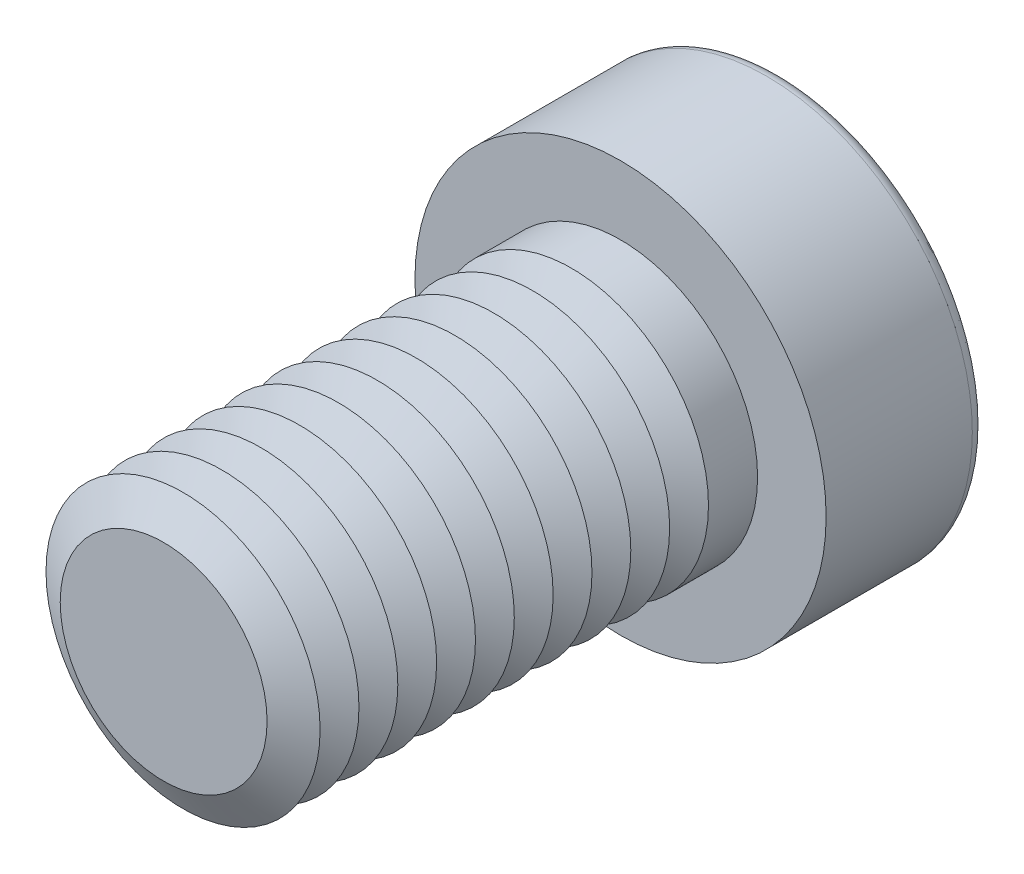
ISO-10303-21;
HEADER;
FILE_DESCRIPTION(('STEP AP214'),'2;1');
FILE_NAME('part.step','',(''),(''),'','','');
FILE_SCHEMA(('AUTOMOTIVE_DESIGN { 1 0 10303 214 1 1 1 1 }'));
ENDSEC;
DATA;
#1=APPLICATION_CONTEXT('core data for automotive mechanical design processes');
#2=APPLICATION_PROTOCOL_DEFINITION('international standard','automotive_design',2000,#1);
#3=PRODUCT_CONTEXT('',#1,'mechanical');
#4=PRODUCT('Part','Part','',(#3));
#5=PRODUCT_RELATED_PRODUCT_CATEGORY('part','',(#4));
#6=PRODUCT_DEFINITION_FORMATION('','',#4);
#7=PRODUCT_DEFINITION_CONTEXT('part definition',#1,'design');
#8=PRODUCT_DEFINITION('design','',#6,#7);
#9=PRODUCT_DEFINITION_SHAPE('','',#8);
#10=(LENGTH_UNIT() NAMED_UNIT(*) SI_UNIT(.MILLI.,.METRE.));
#11=(NAMED_UNIT(*) PLANE_ANGLE_UNIT() SI_UNIT($,.RADIAN.));
#12=(NAMED_UNIT(*) SI_UNIT($,.STERADIAN.) SOLID_ANGLE_UNIT());
#13=UNCERTAINTY_MEASURE_WITH_UNIT(LENGTH_MEASURE(1.E-05),#10,'distance_accuracy_value','');
#14=(GEOMETRIC_REPRESENTATION_CONTEXT(3) GLOBAL_UNCERTAINTY_ASSIGNED_CONTEXT((#13)) GLOBAL_UNIT_ASSIGNED_CONTEXT((#10,
#11,#12)) REPRESENTATION_CONTEXT('',''));
#15=CARTESIAN_POINT('',(0.,0.,0.));
#16=DIRECTION('',(0.,0.,1.));
#17=DIRECTION('',(1.,0.,0.));
#18=AXIS2_PLACEMENT_3D('',#15,#16,#17);
#19=CARTESIAN_POINT('',(0.,0.,14.05));
#20=DIRECTION('',(0.,0.,1.));
#21=DIRECTION('',(1.,0.,0.));
#22=AXIS2_PLACEMENT_3D('',#19,#20,#21);
#23=CONICAL_SURFACE('',#22,6.,1.0471975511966);
#24=CARTESIAN_POINT('',(0.,0.,13.2));
#25=DIRECTION('',(0.,0.,1.));
#26=DIRECTION('',(1.,0.,0.));
#27=AXIS2_PLACEMENT_3D('',#24,#25,#26);
#28=CIRCLE('',#27,4.52775681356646);
#29=CARTESIAN_POINT('',(4.52775681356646,0.,13.2));
#30=VERTEX_POINT('',#29);
#31=EDGE_CURVE('E313',#30,#30,#28,.T.);
#32=ORIENTED_EDGE('',*,*,#31,.T.);
#33=EDGE_LOOP('',(#32));
#34=FACE_BOUND('',#33,.T.);
#35=CARTESIAN_POINT('',(0.,0.,14.05));
#36=DIRECTION('',(0.,0.,1.));
#37=DIRECTION('',(1.,0.,0.));
#38=AXIS2_PLACEMENT_3D('',#35,#36,#37);
#39=CIRCLE('',#38,6.);
#40=CARTESIAN_POINT('',(6.,0.,14.05));
#41=VERTEX_POINT('',#40);
#42=EDGE_CURVE('E316',#41,#41,#39,.T.);
#43=ORIENTED_EDGE('',*,*,#42,.F.);
#44=EDGE_LOOP('',(#43));
#45=FACE_BOUND('',#44,.T.);
#46=ADVANCED_FACE('F39',(#34,#45),#23,.T.);
#47=CARTESIAN_POINT('',(0.,0.,13.2));
#48=DIRECTION('',(0.,0.,-1.));
#49=DIRECTION('',(-1.,0.,0.));
#50=AXIS2_PLACEMENT_3D('',#47,#48,#49);
#51=CONICAL_SURFACE('',#50,4.52775681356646,1.04719755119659);
#52=CARTESIAN_POINT('',(0.,0.,12.35));
#53=DIRECTION('',(0.,0.,1.));
#54=DIRECTION('',(1.,0.,0.));
#55=AXIS2_PLACEMENT_3D('',#52,#53,#54);
#56=CIRCLE('',#55,6.);
#57=CARTESIAN_POINT('',(6.,0.,12.35));
#58=VERTEX_POINT('',#57);
#59=EDGE_CURVE('E324',#58,#58,#56,.T.);
#60=ORIENTED_EDGE('',*,*,#59,.T.);
#61=EDGE_LOOP('',(#60));
#62=FACE_BOUND('',#61,.T.);
#63=ORIENTED_EDGE('',*,*,#31,.F.);
#64=EDGE_LOOP('',(#63));
#65=FACE_BOUND('',#64,.T.);
#66=ADVANCED_FACE('F245',(#62,#65),#51,.T.);
#67=CARTESIAN_POINT('',(0.,0.,20.));
#68=DIRECTION('',(0.,0.,1.));
#69=DIRECTION('',(1.,0.,0.));
#70=AXIS2_PLACEMENT_3D('',#67,#68,#69);
#71=PLANE('',#70);
#72=CARTESIAN_POINT('',(0.,0.,20.));
#73=DIRECTION('',(0.,0.,1.));
#74=DIRECTION('',(1.,0.,0.));
#75=AXIS2_PLACEMENT_3D('',#72,#73,#74);
#76=CIRCLE('',#75,4.52775681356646);
#77=CARTESIAN_POINT('',(4.52775681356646,0.,20.));
#78=VERTEX_POINT('',#77);
#79=EDGE_CURVE('E174',#78,#78,#76,.T.);
#80=ORIENTED_EDGE('',*,*,#79,.T.);
#81=EDGE_LOOP('',(#80));
#82=FACE_BOUND('',#81,.T.);
#83=ADVANCED_FACE('F251',(#82),#71,.T.);
#84=CARTESIAN_POINT('',(0.,0.,20.));
#85=DIRECTION('',(0.,0.,-1.));
#86=DIRECTION('',(-1.,0.,0.));
#87=AXIS2_PLACEMENT_3D('',#84,#85,#86);
#88=CONICAL_SURFACE('',#87,4.52775681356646,1.04719755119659);
#89=CARTESIAN_POINT('',(0.,0.,19.15));
#90=DIRECTION('',(0.,0.,1.));
#91=DIRECTION('',(1.,0.,0.));
#92=AXIS2_PLACEMENT_3D('',#89,#90,#91);
#93=CIRCLE('',#92,6.);
#94=CARTESIAN_POINT('',(6.,0.,19.15));
#95=VERTEX_POINT('',#94);
#96=EDGE_CURVE('E291',#95,#95,#93,.T.);
#97=ORIENTED_EDGE('',*,*,#96,.T.);
#98=EDGE_LOOP('',(#97));
#99=FACE_BOUND('',#98,.T.);
#100=ORIENTED_EDGE('',*,*,#79,.F.);
#101=EDGE_LOOP('',(#100));
#102=FACE_BOUND('',#101,.T.);
#103=ADVANCED_FACE('F199',(#99,#102),#88,.T.);
#104=CARTESIAN_POINT('',(0.,0.,19.15));
#105=DIRECTION('',(0.,0.,1.));
#106=DIRECTION('',(1.,0.,0.));
#107=AXIS2_PLACEMENT_3D('',#104,#105,#106);
#108=CONICAL_SURFACE('',#107,6.,1.0471975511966);
#109=CARTESIAN_POINT('',(0.,0.,18.3));
#110=DIRECTION('',(0.,0.,1.));
#111=DIRECTION('',(1.,0.,0.));
#112=AXIS2_PLACEMENT_3D('',#109,#110,#111);
#113=CIRCLE('',#112,4.52775681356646);
#114=CARTESIAN_POINT('',(4.52775681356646,0.,18.3));
#115=VERTEX_POINT('',#114);
#116=EDGE_CURVE('E288',#115,#115,#113,.T.);
#117=ORIENTED_EDGE('',*,*,#116,.T.);
#118=EDGE_LOOP('',(#117));
#119=FACE_BOUND('',#118,.T.);
#120=ORIENTED_EDGE('',*,*,#96,.F.);
#121=EDGE_LOOP('',(#120));
#122=FACE_BOUND('',#121,.T.);
#123=ADVANCED_FACE('F277',(#119,#122),#108,.T.);
#124=CARTESIAN_POINT('',(0.,0.,18.3));
#125=DIRECTION('',(0.,0.,-1.));
#126=DIRECTION('',(-1.,0.,0.));
#127=AXIS2_PLACEMENT_3D('',#124,#125,#126);
#128=CONICAL_SURFACE('',#127,4.52775681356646,1.04719755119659);
#129=CARTESIAN_POINT('',(0.,0.,17.45));
#130=DIRECTION('',(0.,0.,1.));
#131=DIRECTION('',(1.,0.,0.));
#132=AXIS2_PLACEMENT_3D('',#129,#130,#131);
#133=CIRCLE('',#132,6.);
#134=CARTESIAN_POINT('',(6.,0.,17.45));
#135=VERTEX_POINT('',#134);
#136=EDGE_CURVE('E300',#135,#135,#133,.T.);
#137=ORIENTED_EDGE('',*,*,#136,.T.);
#138=EDGE_LOOP('',(#137));
#139=FACE_BOUND('',#138,.T.);
#140=ORIENTED_EDGE('',*,*,#116,.F.);
#141=EDGE_LOOP('',(#140));
#142=FACE_BOUND('',#141,.T.);
#143=ADVANCED_FACE('F274',(#139,#142),#128,.T.);
#144=CARTESIAN_POINT('',(0.,0.,17.45));
#145=DIRECTION('',(0.,0.,1.));
#146=DIRECTION('',(1.,0.,0.));
#147=AXIS2_PLACEMENT_3D('',#144,#145,#146);
#148=CONICAL_SURFACE('',#147,6.,1.0471975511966);
#149=CARTESIAN_POINT('',(0.,0.,16.6));
#150=DIRECTION('',(0.,0.,1.));
#151=DIRECTION('',(1.,0.,0.));
#152=AXIS2_PLACEMENT_3D('',#149,#150,#151);
#153=CIRCLE('',#152,4.52775681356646);
#154=CARTESIAN_POINT('',(4.52775681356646,0.,16.6));
#155=VERTEX_POINT('',#154);
#156=EDGE_CURVE('E293',#155,#155,#153,.T.);
#157=ORIENTED_EDGE('',*,*,#156,.T.);
#158=EDGE_LOOP('',(#157));
#159=FACE_BOUND('',#158,.T.);
#160=ORIENTED_EDGE('',*,*,#136,.F.);
#161=EDGE_LOOP('',(#160));
#162=FACE_BOUND('',#161,.T.);
#163=ADVANCED_FACE('F270',(#159,#162),#148,.T.);
#164=CARTESIAN_POINT('',(0.,0.,16.6));
#165=DIRECTION('',(0.,0.,-1.));
#166=DIRECTION('',(-1.,0.,0.));
#167=AXIS2_PLACEMENT_3D('',#164,#165,#166);
#168=CONICAL_SURFACE('',#167,4.52775681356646,1.04719755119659);
#169=CARTESIAN_POINT('',(0.,0.,15.75));
#170=DIRECTION('',(0.,0.,1.));
#171=DIRECTION('',(1.,0.,0.));
#172=AXIS2_PLACEMENT_3D('',#169,#170,#171);
#173=CIRCLE('',#172,6.);
#174=CARTESIAN_POINT('',(6.,0.,15.75));
#175=VERTEX_POINT('',#174);
#176=EDGE_CURVE('E310',#175,#175,#173,.T.);
#177=ORIENTED_EDGE('',*,*,#176,.T.);
#178=EDGE_LOOP('',(#177));
#179=FACE_BOUND('',#178,.T.);
#180=ORIENTED_EDGE('',*,*,#156,.F.);
#181=EDGE_LOOP('',(#180));
#182=FACE_BOUND('',#181,.T.);
#183=ADVANCED_FACE('F266',(#179,#182),#168,.T.);
#184=CARTESIAN_POINT('',(0.,0.,15.75));
#185=DIRECTION('',(0.,0.,1.));
#186=DIRECTION('',(1.,0.,0.));
#187=AXIS2_PLACEMENT_3D('',#184,#185,#186);
#188=CONICAL_SURFACE('',#187,6.,1.0471975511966);
#189=CARTESIAN_POINT('',(0.,0.,14.9));
#190=DIRECTION('',(0.,0.,1.));
#191=DIRECTION('',(1.,0.,0.));
#192=AXIS2_PLACEMENT_3D('',#189,#190,#191);
#193=CIRCLE('',#192,4.52775681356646);
#194=CARTESIAN_POINT('',(4.52775681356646,0.,14.9));
#195=VERTEX_POINT('',#194);
#196=EDGE_CURVE('E306',#195,#195,#193,.T.);
#197=ORIENTED_EDGE('',*,*,#196,.T.);
#198=EDGE_LOOP('',(#197));
#199=FACE_BOUND('',#198,.T.);
#200=ORIENTED_EDGE('',*,*,#176,.F.);
#201=EDGE_LOOP('',(#200));
#202=FACE_BOUND('',#201,.T.);
#203=ADVANCED_FACE('F262',(#199,#202),#188,.T.);
#204=CARTESIAN_POINT('',(0.,0.,14.9));
#205=DIRECTION('',(0.,0.,-1.));
#206=DIRECTION('',(-1.,0.,0.));
#207=AXIS2_PLACEMENT_3D('',#204,#205,#206);
#208=CONICAL_SURFACE('',#207,4.52775681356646,1.04719755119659);
#209=ORIENTED_EDGE('',*,*,#42,.T.);
#210=EDGE_LOOP('',(#209));
#211=FACE_BOUND('',#210,.T.);
#212=ORIENTED_EDGE('',*,*,#196,.F.);
#213=EDGE_LOOP('',(#212));
#214=FACE_BOUND('',#213,.T.);
#215=ADVANCED_FACE('F258',(#211,#214),#208,.T.);
#216=CARTESIAN_POINT('',(0.,0.,12.35));
#217=DIRECTION('',(0.,0.,1.));
#218=DIRECTION('',(1.,0.,0.));
#219=AXIS2_PLACEMENT_3D('',#216,#217,#218);
#220=CONICAL_SURFACE('',#219,6.,1.0471975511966);
#221=CARTESIAN_POINT('',(0.,0.,11.5));
#222=DIRECTION('',(0.,0.,1.));
#223=DIRECTION('',(1.,0.,0.));
#224=AXIS2_PLACEMENT_3D('',#221,#222,#223);
#225=CIRCLE('',#224,4.52775681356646);
#226=CARTESIAN_POINT('',(4.52775681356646,0.,11.5));
#227=VERTEX_POINT('',#226);
#228=EDGE_CURVE('E320',#227,#227,#225,.T.);
#229=ORIENTED_EDGE('',*,*,#228,.T.);
#230=EDGE_LOOP('',(#229));
#231=FACE_BOUND('',#230,.T.);
#232=ORIENTED_EDGE('',*,*,#59,.F.);
#233=EDGE_LOOP('',(#232));
#234=FACE_BOUND('',#233,.T.);
#235=ADVANCED_FACE('F261',(#231,#234),#220,.T.);
#236=CARTESIAN_POINT('',(0.,0.,11.5));
#237=DIRECTION('',(0.,0.,-1.));
#238=DIRECTION('',(-1.,0.,0.));
#239=AXIS2_PLACEMENT_3D('',#236,#237,#238);
#240=CONICAL_SURFACE('',#239,4.52775681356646,1.04719755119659);
#241=CARTESIAN_POINT('',(0.,0.,10.65));
#242=DIRECTION('',(0.,0.,1.));
#243=DIRECTION('',(1.,0.,0.));
#244=AXIS2_PLACEMENT_3D('',#241,#242,#243);
#245=CIRCLE('',#244,6.);
#246=CARTESIAN_POINT('',(6.,0.,10.65));
#247=VERTEX_POINT('',#246);
#248=EDGE_CURVE('E332',#247,#247,#245,.T.);
#249=ORIENTED_EDGE('',*,*,#248,.T.);
#250=EDGE_LOOP('',(#249));
#251=FACE_BOUND('',#250,.T.);
#252=ORIENTED_EDGE('',*,*,#228,.F.);
#253=EDGE_LOOP('',(#252));
#254=FACE_BOUND('',#253,.T.);
#255=ADVANCED_FACE('F417',(#251,#254),#240,.T.);
#256=CARTESIAN_POINT('',(0.,0.,10.65));
#257=DIRECTION('',(0.,0.,1.));
#258=DIRECTION('',(1.,0.,0.));
#259=AXIS2_PLACEMENT_3D('',#256,#257,#258);
#260=CONICAL_SURFACE('',#259,6.,1.0471975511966);
#261=CARTESIAN_POINT('',(0.,0.,9.8));
#262=DIRECTION('',(0.,0.,1.));
#263=DIRECTION('',(1.,0.,0.));
#264=AXIS2_PLACEMENT_3D('',#261,#262,#263);
#265=CIRCLE('',#264,4.52775681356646);
#266=CARTESIAN_POINT('',(4.52775681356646,0.,9.8));
#267=VERTEX_POINT('',#266);
#268=EDGE_CURVE('E328',#267,#267,#265,.T.);
#269=ORIENTED_EDGE('',*,*,#268,.T.);
#270=EDGE_LOOP('',(#269));
#271=FACE_BOUND('',#270,.T.);
#272=ORIENTED_EDGE('',*,*,#248,.F.);
#273=EDGE_LOOP('',(#272));
#274=FACE_BOUND('',#273,.T.);
#275=ADVANCED_FACE('F413',(#271,#274),#260,.T.);
#276=CARTESIAN_POINT('',(0.,0.,9.8));
#277=DIRECTION('',(0.,0.,-1.));
#278=DIRECTION('',(-1.,0.,0.));
#279=AXIS2_PLACEMENT_3D('',#276,#277,#278);
#280=CONICAL_SURFACE('',#279,4.52775681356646,1.04719755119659);
#281=CARTESIAN_POINT('',(0.,0.,8.94999999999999));
#282=DIRECTION('',(0.,0.,1.));
#283=DIRECTION('',(1.,0.,0.));
#284=AXIS2_PLACEMENT_3D('',#281,#282,#283);
#285=CIRCLE('',#284,6.);
#286=CARTESIAN_POINT('',(6.,0.,8.94999999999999));
#287=VERTEX_POINT('',#286);
#288=EDGE_CURVE('E340',#287,#287,#285,.T.);
#289=ORIENTED_EDGE('',*,*,#288,.T.);
#290=EDGE_LOOP('',(#289));
#291=FACE_BOUND('',#290,.T.);
#292=ORIENTED_EDGE('',*,*,#268,.F.);
#293=EDGE_LOOP('',(#292));
#294=FACE_BOUND('',#293,.T.);
#295=ADVANCED_FACE('F409',(#291,#294),#280,.T.);
#296=CARTESIAN_POINT('',(0.,0.,8.94999999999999));
#297=DIRECTION('',(0.,0.,1.));
#298=DIRECTION('',(1.,0.,0.));
#299=AXIS2_PLACEMENT_3D('',#296,#297,#298);
#300=CONICAL_SURFACE('',#299,6.,1.0471975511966);
#301=CARTESIAN_POINT('',(0.,0.,8.1));
#302=DIRECTION('',(0.,0.,1.));
#303=DIRECTION('',(1.,0.,0.));
#304=AXIS2_PLACEMENT_3D('',#301,#302,#303);
#305=CIRCLE('',#304,4.52775681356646);
#306=CARTESIAN_POINT('',(4.52775681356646,0.,8.1));
#307=VERTEX_POINT('',#306);
#308=EDGE_CURVE('E336',#307,#307,#305,.T.);
#309=ORIENTED_EDGE('',*,*,#308,.T.);
#310=EDGE_LOOP('',(#309));
#311=FACE_BOUND('',#310,.T.);
#312=ORIENTED_EDGE('',*,*,#288,.F.);
#313=EDGE_LOOP('',(#312));
#314=FACE_BOUND('',#313,.T.);
#315=ADVANCED_FACE('F405',(#311,#314),#300,.T.);
#316=CARTESIAN_POINT('',(0.,0.,8.1));
#317=DIRECTION('',(0.,0.,-1.));
#318=DIRECTION('',(-1.,0.,0.));
#319=AXIS2_PLACEMENT_3D('',#316,#317,#318);
#320=CONICAL_SURFACE('',#319,4.52775681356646,1.04719755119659);
#321=CARTESIAN_POINT('',(0.,0.,7.24999999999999));
#322=DIRECTION('',(0.,0.,1.));
#323=DIRECTION('',(1.,0.,0.));
#324=AXIS2_PLACEMENT_3D('',#321,#322,#323);
#325=CIRCLE('',#324,6.);
#326=CARTESIAN_POINT('',(6.,0.,7.24999999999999));
#327=VERTEX_POINT('',#326);
#328=EDGE_CURVE('E348',#327,#327,#325,.T.);
#329=ORIENTED_EDGE('',*,*,#328,.T.);
#330=EDGE_LOOP('',(#329));
#331=FACE_BOUND('',#330,.T.);
#332=ORIENTED_EDGE('',*,*,#308,.F.);
#333=EDGE_LOOP('',(#332));
#334=FACE_BOUND('',#333,.T.);
#335=ADVANCED_FACE('F401',(#331,#334),#320,.T.);
#336=CARTESIAN_POINT('',(0.,0.,7.24999999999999));
#337=DIRECTION('',(0.,0.,1.));
#338=DIRECTION('',(1.,0.,0.));
#339=AXIS2_PLACEMENT_3D('',#336,#337,#338);
#340=CONICAL_SURFACE('',#339,6.,1.0471975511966);
#341=CARTESIAN_POINT('',(0.,0.,6.4));
#342=DIRECTION('',(0.,0.,1.));
#343=DIRECTION('',(1.,0.,0.));
#344=AXIS2_PLACEMENT_3D('',#341,#342,#343);
#345=CIRCLE('',#344,4.52775681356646);
#346=CARTESIAN_POINT('',(4.52775681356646,0.,6.4));
#347=VERTEX_POINT('',#346);
#348=EDGE_CURVE('E344',#347,#347,#345,.T.);
#349=ORIENTED_EDGE('',*,*,#348,.T.);
#350=EDGE_LOOP('',(#349));
#351=FACE_BOUND('',#350,.T.);
#352=ORIENTED_EDGE('',*,*,#328,.F.);
#353=EDGE_LOOP('',(#352));
#354=FACE_BOUND('',#353,.T.);
#355=ADVANCED_FACE('F397',(#351,#354),#340,.T.);
#356=CARTESIAN_POINT('',(0.,0.,6.4));
#357=DIRECTION('',(0.,0.,-1.));
#358=DIRECTION('',(-1.,0.,0.));
#359=AXIS2_PLACEMENT_3D('',#356,#357,#358);
#360=CONICAL_SURFACE('',#359,4.52775681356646,1.04719755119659);
#361=CARTESIAN_POINT('',(0.,0.,5.54999999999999));
#362=DIRECTION('',(0.,0.,1.));
#363=DIRECTION('',(1.,0.,0.));
#364=AXIS2_PLACEMENT_3D('',#361,#362,#363);
#365=CIRCLE('',#364,6.);
#366=CARTESIAN_POINT('',(6.,0.,5.54999999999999));
#367=VERTEX_POINT('',#366);
#368=EDGE_CURVE('E356',#367,#367,#365,.T.);
#369=ORIENTED_EDGE('',*,*,#368,.T.);
#370=EDGE_LOOP('',(#369));
#371=FACE_BOUND('',#370,.T.);
#372=ORIENTED_EDGE('',*,*,#348,.F.);
#373=EDGE_LOOP('',(#372));
#374=FACE_BOUND('',#373,.T.);
#375=ADVANCED_FACE('F393',(#371,#374),#360,.T.);
#376=CARTESIAN_POINT('',(0.,0.,5.54999999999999));
#377=DIRECTION('',(0.,0.,1.));
#378=DIRECTION('',(1.,0.,0.));
#379=AXIS2_PLACEMENT_3D('',#376,#377,#378);
#380=CONICAL_SURFACE('',#379,6.,1.0471975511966);
#381=CARTESIAN_POINT('',(0.,0.,4.7));
#382=DIRECTION('',(0.,0.,1.));
#383=DIRECTION('',(1.,0.,0.));
#384=AXIS2_PLACEMENT_3D('',#381,#382,#383);
#385=CIRCLE('',#384,4.52775681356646);
#386=CARTESIAN_POINT('',(4.52775681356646,0.,4.7));
#387=VERTEX_POINT('',#386);
#388=EDGE_CURVE('E352',#387,#387,#385,.T.);
#389=ORIENTED_EDGE('',*,*,#388,.T.);
#390=EDGE_LOOP('',(#389));
#391=FACE_BOUND('',#390,.T.);
#392=ORIENTED_EDGE('',*,*,#368,.F.);
#393=EDGE_LOOP('',(#392));
#394=FACE_BOUND('',#393,.T.);
#395=ADVANCED_FACE('F388',(#391,#394),#380,.T.);
#396=CARTESIAN_POINT('',(0.,0.,4.7));
#397=DIRECTION('',(0.,0.,-1.));
#398=DIRECTION('',(-1.,0.,0.));
#399=AXIS2_PLACEMENT_3D('',#396,#397,#398);
#400=CONICAL_SURFACE('',#399,4.52775681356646,1.04719755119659);
#401=CARTESIAN_POINT('',(0.,0.,3.85));
#402=DIRECTION('',(0.,0.,1.));
#403=DIRECTION('',(1.,0.,0.));
#404=AXIS2_PLACEMENT_3D('',#401,#402,#403);
#405=CIRCLE('',#404,6.);
#406=CARTESIAN_POINT('',(6.,0.,3.85));
#407=VERTEX_POINT('',#406);
#408=EDGE_CURVE('E368',#407,#407,#405,.T.);
#409=ORIENTED_EDGE('',*,*,#408,.T.);
#410=EDGE_LOOP('',(#409));
#411=FACE_BOUND('',#410,.T.);
#412=ORIENTED_EDGE('',*,*,#388,.F.);
#413=EDGE_LOOP('',(#412));
#414=FACE_BOUND('',#413,.T.);
#415=ADVANCED_FACE('F374',(#411,#414),#400,.T.);
#416=CARTESIAN_POINT('',(0.,0.,3.85));
#417=DIRECTION('',(0.,0.,1.));
#418=DIRECTION('',(1.,0.,0.));
#419=AXIS2_PLACEMENT_3D('',#416,#417,#418);
#420=CONICAL_SURFACE('',#419,6.,1.0471975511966);
#421=CARTESIAN_POINT('',(0.,0.,3.00000000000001));
#422=DIRECTION('',(0.,0.,1.));
#423=DIRECTION('',(1.,0.,0.));
#424=AXIS2_PLACEMENT_3D('',#421,#422,#423);
#425=CIRCLE('',#424,4.52775681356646);
#426=CARTESIAN_POINT('',(4.52775681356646,0.,3.00000000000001));
#427=VERTEX_POINT('',#426);
#428=EDGE_CURVE('E360',#427,#427,#425,.T.);
#429=ORIENTED_EDGE('',*,*,#428,.T.);
#430=EDGE_LOOP('',(#429));
#431=FACE_BOUND('',#430,.T.);
#432=ORIENTED_EDGE('',*,*,#408,.F.);
#433=EDGE_LOOP('',(#432));
#434=FACE_BOUND('',#433,.T.);
#435=ADVANCED_FACE('F377',(#431,#434),#420,.T.);
#436=CARTESIAN_POINT('',(0.,0.,3.00000000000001));
#437=DIRECTION('',(0.,0.,-1.));
#438=DIRECTION('',(-1.,0.,0.));
#439=AXIS2_PLACEMENT_3D('',#436,#437,#438);
#440=CONICAL_SURFACE('',#439,4.52775681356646,1.04719755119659);
#441=CARTESIAN_POINT('',(0.,0.,2.15));
#442=DIRECTION('',(0.,0.,1.));
#443=DIRECTION('',(1.,0.,0.));
#444=AXIS2_PLACEMENT_3D('',#441,#442,#443);
#445=CIRCLE('',#444,6.);
#446=CARTESIAN_POINT('',(6.,0.,2.15));
#447=VERTEX_POINT('',#446);
#448=EDGE_CURVE('E364',#447,#447,#445,.T.);
#449=ORIENTED_EDGE('',*,*,#448,.T.);
#450=EDGE_LOOP('',(#449));
#451=FACE_BOUND('',#450,.T.);
#452=ORIENTED_EDGE('',*,*,#428,.F.);
#453=EDGE_LOOP('',(#452));
#454=FACE_BOUND('',#453,.T.);
#455=ADVANCED_FACE('F379',(#451,#454),#440,.T.);
#456=CARTESIAN_POINT('',(0.,0.,-1.));
#457=DIRECTION('',(0.,0.,-1.));
#458=DIRECTION('',(-1.,0.,0.));
#459=AXIS2_PLACEMENT_3D('',#456,#457,#458);
#460=CONICAL_SURFACE('',#459,4.,1.0471975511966);
#461=CARTESIAN_POINT('',(0.,0.,1.30940107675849));
#462=VERTEX_POINT('',#461);
#463=VERTEX_LOOP('',#462);
#464=FACE_BOUND('',#463,.T.);
#465=CARTESIAN_POINT('',(0.,0.,-1.));
#466=DIRECTION('',(0.,0.,-1.));
#467=DIRECTION('',(-1.,0.,0.));
#468=AXIS2_PLACEMENT_3D('',#465,#466,#467);
#469=CIRCLE('',#468,4.);
#470=CARTESIAN_POINT('',(-3.46410161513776,2.,-1.));
#471=VERTEX_POINT('',#470);
#472=CARTESIAN_POINT('',(0.,4.,-1.));
#473=VERTEX_POINT('',#472);
#474=EDGE_CURVE('E149',#471,#473,#469,.T.);
#475=ORIENTED_EDGE('',*,*,#474,.T.);
#476=CARTESIAN_POINT('',(0.,0.,-1.));
#477=DIRECTION('',(0.,0.,-1.));
#478=DIRECTION('',(-1.,0.,0.));
#479=AXIS2_PLACEMENT_3D('',#476,#477,#478);
#480=CIRCLE('',#479,4.);
#481=CARTESIAN_POINT('',(3.46410161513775,2.,-1.));
#482=VERTEX_POINT('',#481);
#483=EDGE_CURVE('E54',#473,#482,#480,.T.);
#484=ORIENTED_EDGE('',*,*,#483,.T.);
#485=CARTESIAN_POINT('',(3.46410161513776,-2.,-1.));
#486=VERTEX_POINT('',#485);
#487=EDGE_CURVE('E848',#482,#486,#480,.T.);
#488=ORIENTED_EDGE('',*,*,#487,.T.);
#489=CARTESIAN_POINT('',(0.,-4.,-1.));
#490=VERTEX_POINT('',#489);
#491=EDGE_CURVE('E846',#486,#490,#480,.T.);
#492=ORIENTED_EDGE('',*,*,#491,.T.);
#493=CARTESIAN_POINT('',(-3.46410161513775,-2.,-1.));
#494=VERTEX_POINT('',#493);
#495=EDGE_CURVE('E840',#490,#494,#480,.T.);
#496=ORIENTED_EDGE('',*,*,#495,.T.);
#497=EDGE_CURVE('E838',#494,#471,#480,.T.);
#498=ORIENTED_EDGE('',*,*,#497,.T.);
#499=EDGE_LOOP('',(#475,#484,#488,#492,#496,#498));
#500=FACE_BOUND('',#499,.T.);
#501=ADVANCED_FACE('F201',(#464,#500),#460,.F.);
#502=CARTESIAN_POINT('',(0.,0.,-1.));
#503=DIRECTION('',(0.,0.,-1.));
#504=DIRECTION('',(-1.,0.,0.));
#505=AXIS2_PLACEMENT_3D('',#502,#503,#504);
#506=PLANE('',#505);
#507=ORIENTED_EDGE('',*,*,#483,.F.);
#508=DIRECTION('',(1.,0.,0.));
#509=VECTOR('',#508,1.);
#510=CARTESIAN_POINT('',(-2.3094010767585,4.,-1.));
#511=LINE('',#510,#509);
#512=CARTESIAN_POINT('',(2.3094010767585,4.,-1.));
#513=VERTEX_POINT('',#512);
#514=EDGE_CURVE('E892',#473,#513,#511,.T.);
#515=ORIENTED_EDGE('',*,*,#514,.T.);
#516=DIRECTION('',(0.5,-0.866025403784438,0.));
#517=VECTOR('',#516,1.);
#518=CARTESIAN_POINT('',(2.3094010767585,4.,-1.));
#519=LINE('',#518,#517);
#520=EDGE_CURVE('E155',#513,#482,#519,.T.);
#521=ORIENTED_EDGE('',*,*,#520,.T.);
#522=EDGE_LOOP('',(#507,#515,#521));
#523=FACE_BOUND('',#522,.T.);
#524=ADVANCED_FACE('F476',(#523),#506,.T.);
#525=ORIENTED_EDGE('',*,*,#487,.F.);
#526=CARTESIAN_POINT('',(4.61880215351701,0.,-1.));
#527=VERTEX_POINT('',#526);
#528=EDGE_CURVE('E889',#482,#527,#519,.T.);
#529=ORIENTED_EDGE('',*,*,#528,.T.);
#530=DIRECTION('',(-0.5,-0.866025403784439,0.));
#531=VECTOR('',#530,1.);
#532=CARTESIAN_POINT('',(4.61880215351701,0.,-1.));
#533=LINE('',#532,#531);
#534=EDGE_CURVE('E863',#527,#486,#533,.T.);
#535=ORIENTED_EDGE('',*,*,#534,.T.);
#536=EDGE_LOOP('',(#525,#529,#535));
#537=FACE_BOUND('',#536,.T.);
#538=ADVANCED_FACE('F486',(#537),#506,.T.);
#539=ORIENTED_EDGE('',*,*,#491,.F.);
#540=CARTESIAN_POINT('',(2.3094010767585,-4.,-1.));
#541=VERTEX_POINT('',#540);
#542=EDGE_CURVE('E865',#486,#541,#533,.T.);
#543=ORIENTED_EDGE('',*,*,#542,.T.);
#544=DIRECTION('',(-1.,0.,0.));
#545=VECTOR('',#544,1.);
#546=CARTESIAN_POINT('',(2.3094010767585,-4.,-1.));
#547=LINE('',#546,#545);
#548=EDGE_CURVE('E814',#541,#490,#547,.T.);
#549=ORIENTED_EDGE('',*,*,#548,.T.);
#550=EDGE_LOOP('',(#539,#543,#549));
#551=FACE_BOUND('',#550,.T.);
#552=ADVANCED_FACE('F496',(#551),#506,.T.);
#553=ORIENTED_EDGE('',*,*,#495,.F.);
#554=CARTESIAN_POINT('',(-2.3094010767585,-4.,-1.));
#555=VERTEX_POINT('',#554);
#556=EDGE_CURVE('E859',#490,#555,#547,.T.);
#557=ORIENTED_EDGE('',*,*,#556,.T.);
#558=DIRECTION('',(-0.5,0.866025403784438,0.));
#559=VECTOR('',#558,1.);
#560=CARTESIAN_POINT('',(-2.3094010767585,-4.,-1.));
#561=LINE('',#560,#559);
#562=EDGE_CURVE('E861',#555,#494,#561,.T.);
#563=ORIENTED_EDGE('',*,*,#562,.T.);
#564=EDGE_LOOP('',(#553,#557,#563));
#565=FACE_BOUND('',#564,.T.);
#566=ADVANCED_FACE('F504',(#565),#506,.T.);
#567=ORIENTED_EDGE('',*,*,#497,.F.);
#568=CARTESIAN_POINT('',(-4.61880215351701,0.,-1.));
#569=VERTEX_POINT('',#568);
#570=EDGE_CURVE('E866',#494,#569,#561,.T.);
#571=ORIENTED_EDGE('',*,*,#570,.T.);
#572=DIRECTION('',(0.5,0.866025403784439,0.));
#573=VECTOR('',#572,1.);
#574=CARTESIAN_POINT('',(-4.61880215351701,0.,-1.));
#575=LINE('',#574,#573);
#576=EDGE_CURVE('E158',#569,#471,#575,.T.);
#577=ORIENTED_EDGE('',*,*,#576,.T.);
#578=EDGE_LOOP('',(#567,#571,#577));
#579=FACE_BOUND('',#578,.T.);
#580=ADVANCED_FACE('F231',(#579),#506,.T.);
#581=ORIENTED_EDGE('',*,*,#474,.F.);
#582=CARTESIAN_POINT('',(-2.3094010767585,4.,-1.));
#583=VERTEX_POINT('',#582);
#584=EDGE_CURVE('E871',#471,#583,#575,.T.);
#585=ORIENTED_EDGE('',*,*,#584,.T.);
#586=EDGE_CURVE('E890',#583,#473,#511,.T.);
#587=ORIENTED_EDGE('',*,*,#586,.T.);
#588=EDGE_LOOP('',(#581,#585,#587));
#589=FACE_BOUND('',#588,.T.);
#590=ADVANCED_FACE('F488',(#589),#506,.T.);
#591=CARTESIAN_POINT('',(-2.3094010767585,4.,-1.));
#592=DIRECTION('',(0.,1.,0.));
#593=DIRECTION('',(0.,0.,1.));
#594=AXIS2_PLACEMENT_3D('',#591,#592,#593);
#595=PLANE('',#594);
#596=DIRECTION('',(0.,0.,-1.));
#597=VECTOR('',#596,1.);
#598=CARTESIAN_POINT('',(-2.3094010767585,4.,-1.));
#599=LINE('',#598,#597);
#600=CARTESIAN_POINT('',(-2.3094010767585,4.,-7.));
#601=VERTEX_POINT('',#600);
#602=EDGE_CURVE('E147',#583,#601,#599,.T.);
#603=ORIENTED_EDGE('',*,*,#602,.T.);
#604=CARTESIAN_POINT('',(-6.02881516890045,4.,-7.70103379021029));
#605=CARTESIAN_POINT('',(-5.8481958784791,4.,-7.66071709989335));
#606=CARTESIAN_POINT('',(-5.66746141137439,4.,-7.62090727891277));
#607=CARTESIAN_POINT('',(-5.30570552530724,4.,-7.54257487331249));
#608=CARTESIAN_POINT('',(-5.12468409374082,4.,-7.50405234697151));
#609=CARTESIAN_POINT('',(-4.76212658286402,4.,-7.42853268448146));
#610=CARTESIAN_POINT('',(-4.58059016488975,4.,-7.39153716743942));
#611=CARTESIAN_POINT('',(-4.21713405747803,4.,-7.31948392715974));
#612=CARTESIAN_POINT('',(-4.03521437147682,4.,-7.28442618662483));
#613=CARTESIAN_POINT('',(-3.67250657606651,4.,-7.21700168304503));
#614=CARTESIAN_POINT('',(-3.4917223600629,4.,-7.18461419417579));
#615=CARTESIAN_POINT('',(-3.12965653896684,4.,-7.12275774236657));
#616=CARTESIAN_POINT('',(-2.94837492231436,4.,-7.09328884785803));
#617=CARTESIAN_POINT('',(-2.40374454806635,4.,-7.01026455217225));
#618=CARTESIAN_POINT('',(-2.03952090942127,4.,-6.96207428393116));
#619=CARTESIAN_POINT('',(-1.48950033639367,4.,-6.90518200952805));
#620=CARTESIAN_POINT('',(-1.30450135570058,4.,-6.88873552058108));
#621=CARTESIAN_POINT('',(-0.934053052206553,4.,-6.86198845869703));
#622=CARTESIAN_POINT('',(-0.748603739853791,4.,-6.85168774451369));
#623=CARTESIAN_POINT('',(-0.377528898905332,4.,-6.83783090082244));
#624=CARTESIAN_POINT('',(-0.191903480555,4.,-6.83427186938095));
#625=CARTESIAN_POINT('',(0.179350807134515,4.,-6.83411569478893));
#626=CARTESIAN_POINT('',(0.364979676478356,4.,-6.83751856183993));
#627=CARTESIAN_POINT('',(0.736742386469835,4.,-6.85109802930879));
#628=CARTESIAN_POINT('',(0.922875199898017,4.,-6.86130219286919));
#629=CARTESIAN_POINT('',(1.29469888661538,4.,-6.8879135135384));
#630=CARTESIAN_POINT('',(1.48038973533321,4.,-6.90432100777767));
#631=CARTESIAN_POINT('',(1.85132520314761,4.,-6.94252995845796));
#632=CARTESIAN_POINT('',(2.036569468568,4.,-6.96433479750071));
#633=CARTESIAN_POINT('',(2.40646407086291,4.,-7.0124559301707));
#634=CARTESIAN_POINT('',(2.59111440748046,4.,-7.03877222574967));
#635=CARTESIAN_POINT('',(2.96467049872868,4.,-7.09583231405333));
#636=CARTESIAN_POINT('',(3.15356118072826,4.,-7.12667393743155));
#637=CARTESIAN_POINT('',(3.53080577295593,4.,-7.19148953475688));
#638=CARTESIAN_POINT('',(3.71915966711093,4.,-7.22546360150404));
#639=CARTESIAN_POINT('',(4.2835627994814,4.,-7.33112271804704));
#640=CARTESIAN_POINT('',(4.65891157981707,4.,-7.40653797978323));
#641=CARTESIAN_POINT('',(5.40835351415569,4.,-7.56376983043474));
#642=CARTESIAN_POINT('',(5.78244627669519,4.,-7.64558825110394));
#643=CARTESIAN_POINT('',(6.52968076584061,4.,-7.81348272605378));
#644=CARTESIAN_POINT('',(6.90282246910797,4.,-7.89955888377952));
#645=CARTESIAN_POINT('',(7.64386653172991,4.,-8.07356157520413));
#646=CARTESIAN_POINT('',(8.01177724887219,4.,-8.16145269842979));
#647=CARTESIAN_POINT('',(8.74711499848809,4.,-8.33926751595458));
#648=CARTESIAN_POINT('',(9.11454201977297,4.,-8.42919125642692));
#649=CARTESIAN_POINT('',(9.84851788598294,4.,-8.61039317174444));
#650=CARTESIAN_POINT('',(10.2150672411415,4.,-8.70166928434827));
#651=CARTESIAN_POINT('',(10.9478692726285,4.,-8.88534974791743));
#652=CARTESIAN_POINT('',(11.3141219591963,4.,-8.97775405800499));
#653=CARTESIAN_POINT('',(11.6802738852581,4.,-9.07055157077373));
#654=B_SPLINE_CURVE_WITH_KNOTS('',3,(#604,#605,#606,#607,#608,#609,#610,#611,#612,#613,#614,
#615,#616,#617,#618,#619,#620,#621,#622,#623,#624,#625,#626,#627,#628,#629,#630,#631,#632,#633,
#634,#635,#636,#637,#638,#639,#640,#641,#642,#643,#644,#645,#646,#647,#648,#649,#650,#651,#652,
#653),.UNSPECIFIED.,.F.,.F.,(4,2,2,2,2,2,2,2,2,2,2,2,2,2,2,2,2,2,2,2,2,2,2,2,4),(0.,
0.555194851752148,1.11041480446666,1.6662090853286,2.22199840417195,2.77296094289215,
3.32393639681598,4.42561440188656,4.98271716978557,5.5398071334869,6.09665724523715,
6.65350817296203,7.2126296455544,7.77178150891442,8.33128469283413,8.89078811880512,
9.46493123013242,10.0390913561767,11.1875388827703,12.3363161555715,13.4851213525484,
14.6199040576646,15.7547125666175,16.8879395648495,18.0211256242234),.UNSPECIFIED.);
#655=CARTESIAN_POINT('',(2.3094010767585,4.,-7.));
#656=VERTEX_POINT('',#655);
#657=EDGE_CURVE('E124',#601,#656,#654,.T.);
#658=ORIENTED_EDGE('',*,*,#657,.T.);
#659=DIRECTION('',(0.,0.,-1.));
#660=VECTOR('',#659,1.);
#661=CARTESIAN_POINT('',(2.3094010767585,4.,-1.));
#662=LINE('',#661,#660);
#663=EDGE_CURVE('E143',#513,#656,#662,.T.);
#664=ORIENTED_EDGE('',*,*,#663,.F.);
#665=ORIENTED_EDGE('',*,*,#514,.F.);
#666=ORIENTED_EDGE('',*,*,#586,.F.);
#667=EDGE_LOOP('',(#603,#658,#664,#665,#666));
#668=FACE_BOUND('',#667,.T.);
#669=ADVANCED_FACE('F141',(#668),#595,.F.);
#670=CARTESIAN_POINT('',(2.3094010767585,4.,-1.));
#671=DIRECTION('',(0.866025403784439,0.5,0.));
#672=DIRECTION('',(-0.5,0.866025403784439,0.));
#673=AXIS2_PLACEMENT_3D('',#670,#671,#672);
#674=PLANE('',#673);
#675=ORIENTED_EDGE('',*,*,#663,.T.);
#676=CARTESIAN_POINT('',(2.30928560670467,4.0002,-7.0000309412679));
#677=CARTESIAN_POINT('',(2.40519879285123,3.83407348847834,-6.97431943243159));
#678=CARTESIAN_POINT('',(2.50128588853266,3.66764575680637,-6.95097756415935));
#679=CARTESIAN_POINT('',(2.69379944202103,3.33420250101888,-6.90996801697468));
#680=CARTESIAN_POINT('',(2.79022602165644,3.16718676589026,-6.89230264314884));
#681=CARTESIAN_POINT('',(2.98283386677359,2.83358019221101,-6.86367744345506));
#682=CARTESIAN_POINT('',(3.07901382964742,2.66699160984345,-6.85268347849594));
#683=CARTESIAN_POINT('',(3.27149641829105,2.33360198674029,-6.83794168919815));
#684=CARTESIAN_POINT('',(3.3677990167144,2.16680099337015,-6.83419246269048));
#685=CARTESIAN_POINT('',(3.56040421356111,1.83319900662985,-6.83419246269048));
#686=CARTESIAN_POINT('',(3.65670681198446,1.66639801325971,-6.83794168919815));
#687=CARTESIAN_POINT('',(3.84918940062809,1.33300839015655,-6.85268347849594));
#688=CARTESIAN_POINT('',(3.94536936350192,1.16641980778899,-6.86367744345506));
#689=CARTESIAN_POINT('',(4.13797720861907,0.832813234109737,-6.89230264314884));
#690=CARTESIAN_POINT('',(4.23440378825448,0.66579749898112,-6.90996801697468));
#691=CARTESIAN_POINT('',(4.42691734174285,0.332354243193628,-6.95097756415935));
#692=CARTESIAN_POINT('',(4.52300443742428,0.165926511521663,-6.97431943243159));
#693=CARTESIAN_POINT('',(4.61891762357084,-0.000199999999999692,-7.0000309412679));
#694=B_SPLINE_CURVE_WITH_KNOTS('',3,(#676,#677,#678,#679,#680,#681,#682,#683,#684,#685,#686,
#687,#688,#689,#690,#691,#692,#693),.UNSPECIFIED.,.F.,.F.,(4,2,2,2,2,2,2,2,4),(0.,
0.580655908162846,1.1615473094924,1.73944052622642,2.31722188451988,2.89500324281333,
3.47289645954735,4.0537878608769,4.63444376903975),.UNSPECIFIED.);
#695=CARTESIAN_POINT('',(4.61880215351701,0.,-7.));
#696=VERTEX_POINT('',#695);
#697=EDGE_CURVE('E11',#656,#696,#694,.T.);
#698=ORIENTED_EDGE('',*,*,#697,.T.);
#699=DIRECTION('',(0.,0.,-1.));
#700=VECTOR('',#699,1.);
#701=CARTESIAN_POINT('',(4.61880215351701,0.,-1.));
#702=LINE('',#701,#700);
#703=EDGE_CURVE('E157',#527,#696,#702,.T.);
#704=ORIENTED_EDGE('',*,*,#703,.F.);
#705=ORIENTED_EDGE('',*,*,#528,.F.);
#706=ORIENTED_EDGE('',*,*,#520,.F.);
#707=EDGE_LOOP('',(#675,#698,#704,#705,#706));
#708=FACE_BOUND('',#707,.T.);
#709=ADVANCED_FACE('F152',(#708),#674,.F.);
#710=CARTESIAN_POINT('',(4.61880215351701,0.,-1.));
#711=DIRECTION('',(0.866025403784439,-0.5,0.));
#712=DIRECTION('',(0.5,0.866025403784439,0.));
#713=AXIS2_PLACEMENT_3D('',#710,#711,#712);
#714=PLANE('',#713);
#715=ORIENTED_EDGE('',*,*,#703,.T.);
#716=CARTESIAN_POINT('',(4.61891762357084,0.00020000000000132,-7.0000309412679));
#717=CARTESIAN_POINT('',(4.52300443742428,-0.165926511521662,-6.97431943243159));
#718=CARTESIAN_POINT('',(4.42691734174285,-0.332354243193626,-6.95097756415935));
#719=CARTESIAN_POINT('',(4.23440378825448,-0.665797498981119,-6.90996801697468));
#720=CARTESIAN_POINT('',(4.13797720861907,-0.832813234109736,-6.89230264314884));
#721=CARTESIAN_POINT('',(3.94536936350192,-1.16641980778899,-6.86367744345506));
#722=CARTESIAN_POINT('',(3.84918940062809,-1.33300839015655,-6.85268347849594));
#723=CARTESIAN_POINT('',(3.65670681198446,-1.66639801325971,-6.83794168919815));
#724=CARTESIAN_POINT('',(3.56040421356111,-1.83319900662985,-6.83419246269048));
#725=CARTESIAN_POINT('',(3.3677990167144,-2.16680099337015,-6.83419246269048));
#726=CARTESIAN_POINT('',(3.27149641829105,-2.33360198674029,-6.83794168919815));
#727=CARTESIAN_POINT('',(3.07901382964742,-2.66699160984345,-6.85268347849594));
#728=CARTESIAN_POINT('',(2.98283386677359,-2.83358019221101,-6.86367744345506));
#729=CARTESIAN_POINT('',(2.79022602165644,-3.16718676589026,-6.89230264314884));
#730=CARTESIAN_POINT('',(2.69379944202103,-3.33420250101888,-6.90996801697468));
#731=CARTESIAN_POINT('',(2.50128588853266,-3.66764575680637,-6.95097756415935));
#732=CARTESIAN_POINT('',(2.40519879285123,-3.83407348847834,-6.97431943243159));
#733=CARTESIAN_POINT('',(2.30928560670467,-4.0002,-7.0000309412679));
#734=B_SPLINE_CURVE_WITH_KNOTS('',3,(#716,#717,#718,#719,#720,#721,#722,#723,#724,#725,#726,
#727,#728,#729,#730,#731,#732,#733),.UNSPECIFIED.,.F.,.F.,(4,2,2,2,2,2,2,2,4),(0.,
0.580655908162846,1.1615473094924,1.73944052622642,2.31722188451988,2.89500324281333,
3.47289645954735,4.0537878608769,4.63444376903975),.UNSPECIFIED.);
#735=CARTESIAN_POINT('',(2.3094010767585,-4.,-7.));
#736=VERTEX_POINT('',#735);
#737=EDGE_CURVE('E173',#696,#736,#734,.T.);
#738=ORIENTED_EDGE('',*,*,#737,.T.);
#739=DIRECTION('',(0.,0.,-1.));
#740=VECTOR('',#739,1.);
#741=CARTESIAN_POINT('',(2.3094010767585,-4.,-1.));
#742=LINE('',#741,#740);
#743=EDGE_CURVE('E809',#541,#736,#742,.T.);
#744=ORIENTED_EDGE('',*,*,#743,.F.);
#745=ORIENTED_EDGE('',*,*,#542,.F.);
#746=ORIENTED_EDGE('',*,*,#534,.F.);
#747=EDGE_LOOP('',(#715,#738,#744,#745,#746));
#748=FACE_BOUND('',#747,.T.);
#749=ADVANCED_FACE('F191',(#748),#714,.F.);
#750=CARTESIAN_POINT('',(2.3094010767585,-4.,-1.));
#751=DIRECTION('',(0.,-1.,0.));
#752=DIRECTION('',(0.,0.,-1.));
#753=AXIS2_PLACEMENT_3D('',#750,#751,#752);
#754=PLANE('',#753);
#755=ORIENTED_EDGE('',*,*,#743,.T.);
#756=CARTESIAN_POINT('',(-6.02881516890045,-4.,-7.70103379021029));
#757=CARTESIAN_POINT('',(-5.8481958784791,-4.,-7.66071709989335));
#758=CARTESIAN_POINT('',(-5.66746141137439,-4.,-7.62090727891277));
#759=CARTESIAN_POINT('',(-5.30570552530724,-4.,-7.54257487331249));
#760=CARTESIAN_POINT('',(-5.12468409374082,-4.,-7.50405234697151));
#761=CARTESIAN_POINT('',(-4.76212658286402,-4.,-7.42853268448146));
#762=CARTESIAN_POINT('',(-4.58059016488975,-4.,-7.39153716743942));
#763=CARTESIAN_POINT('',(-4.21713405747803,-4.,-7.31948392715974));
#764=CARTESIAN_POINT('',(-4.03521437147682,-4.,-7.28442618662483));
#765=CARTESIAN_POINT('',(-3.67250657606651,-4.,-7.21700168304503));
#766=CARTESIAN_POINT('',(-3.49172236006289,-4.,-7.18461419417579));
#767=CARTESIAN_POINT('',(-3.12965653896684,-4.,-7.12275774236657));
#768=CARTESIAN_POINT('',(-2.94837492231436,-4.,-7.09328884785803));
#769=CARTESIAN_POINT('',(-2.40374454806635,-4.,-7.01026455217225));
#770=CARTESIAN_POINT('',(-2.03952090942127,-4.,-6.96207428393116));
#771=CARTESIAN_POINT('',(-1.48950033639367,-4.,-6.90518200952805));
#772=CARTESIAN_POINT('',(-1.30450135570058,-4.,-6.88873552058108));
#773=CARTESIAN_POINT('',(-0.934053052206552,-4.,-6.86198845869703));
#774=CARTESIAN_POINT('',(-0.748603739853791,-4.,-6.85168774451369));
#775=CARTESIAN_POINT('',(-0.377528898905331,-4.,-6.83783090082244));
#776=CARTESIAN_POINT('',(-0.191903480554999,-4.,-6.83427186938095));
#777=CARTESIAN_POINT('',(0.179350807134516,-4.,-6.83411569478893));
#778=CARTESIAN_POINT('',(0.364979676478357,-4.,-6.83751856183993));
#779=CARTESIAN_POINT('',(0.736742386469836,-4.,-6.85109802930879));
#780=CARTESIAN_POINT('',(0.922875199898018,-4.,-6.86130219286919));
#781=CARTESIAN_POINT('',(1.29469888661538,-4.,-6.8879135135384));
#782=CARTESIAN_POINT('',(1.48038973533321,-4.,-6.90432100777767));
#783=CARTESIAN_POINT('',(1.85132520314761,-4.,-6.94252995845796));
#784=CARTESIAN_POINT('',(2.036569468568,-4.,-6.96433479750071));
#785=CARTESIAN_POINT('',(2.40646407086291,-4.,-7.0124559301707));
#786=CARTESIAN_POINT('',(2.59111440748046,-4.,-7.03877222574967));
#787=CARTESIAN_POINT('',(2.96467049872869,-4.,-7.09583231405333));
#788=CARTESIAN_POINT('',(3.15356118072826,-4.,-7.12667393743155));
#789=CARTESIAN_POINT('',(3.53080577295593,-4.,-7.19148953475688));
#790=CARTESIAN_POINT('',(3.71915966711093,-4.,-7.22546360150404));
#791=CARTESIAN_POINT('',(4.2835627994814,-4.,-7.33112271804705));
#792=CARTESIAN_POINT('',(4.65891157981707,-4.,-7.40653797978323));
#793=CARTESIAN_POINT('',(5.40835351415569,-4.,-7.56376983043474));
#794=CARTESIAN_POINT('',(5.78244627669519,-4.,-7.64558825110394));
#795=CARTESIAN_POINT('',(6.52968076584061,-4.,-7.81348272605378));
#796=CARTESIAN_POINT('',(6.90282246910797,-4.,-7.89955888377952));
#797=CARTESIAN_POINT('',(7.64386653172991,-4.,-8.07356157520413));
#798=CARTESIAN_POINT('',(8.01177724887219,-4.,-8.16145269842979));
#799=CARTESIAN_POINT('',(8.74711499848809,-4.,-8.33926751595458));
#800=CARTESIAN_POINT('',(9.11454201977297,-4.,-8.42919125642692));
#801=CARTESIAN_POINT('',(9.84851788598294,-4.,-8.61039317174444));
#802=CARTESIAN_POINT('',(10.2150672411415,-4.,-8.70166928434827));
#803=CARTESIAN_POINT('',(10.9478692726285,-4.,-8.88534974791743));
#804=CARTESIAN_POINT('',(11.3141219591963,-4.,-8.97775405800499));
#805=CARTESIAN_POINT('',(11.6802738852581,-4.,-9.07055157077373));
#806=B_SPLINE_CURVE_WITH_KNOTS('',3,(#756,#757,#758,#759,#760,#761,#762,#763,#764,#765,#766,
#767,#768,#769,#770,#771,#772,#773,#774,#775,#776,#777,#778,#779,#780,#781,#782,#783,#784,#785,
#786,#787,#788,#789,#790,#791,#792,#793,#794,#795,#796,#797,#798,#799,#800,#801,#802,#803,#804,
#805),.UNSPECIFIED.,.F.,.F.,(4,2,2,2,2,2,2,2,2,2,2,2,2,2,2,2,2,2,2,2,2,2,2,2,4),(0.,
0.555194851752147,1.11041480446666,1.6662090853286,2.22199840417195,2.77296094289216,
3.32393639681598,4.42561440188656,4.98271716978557,5.5398071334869,6.09665724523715,
6.65350817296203,7.2126296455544,7.77178150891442,8.33128469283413,8.89078811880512,
9.46493123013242,10.0390913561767,11.1875388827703,12.3363161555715,13.4851213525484,
14.6199040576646,15.7547125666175,16.8879395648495,18.0211256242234),.UNSPECIFIED.);
#807=CARTESIAN_POINT('',(-2.3094010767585,-4.,-7.));
#808=VERTEX_POINT('',#807);
#809=EDGE_CURVE('E184',#736,#808,#806,.F.);
#810=ORIENTED_EDGE('',*,*,#809,.T.);
#811=DIRECTION('',(0.,0.,-1.));
#812=VECTOR('',#811,1.);
#813=CARTESIAN_POINT('',(-2.3094010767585,-4.,-1.));
#814=LINE('',#813,#812);
#815=EDGE_CURVE('E816',#555,#808,#814,.T.);
#816=ORIENTED_EDGE('',*,*,#815,.F.);
#817=ORIENTED_EDGE('',*,*,#556,.F.);
#818=ORIENTED_EDGE('',*,*,#548,.F.);
#819=EDGE_LOOP('',(#755,#810,#816,#817,#818));
#820=FACE_BOUND('',#819,.T.);
#821=ADVANCED_FACE('F234',(#820),#754,.F.);
#822=CARTESIAN_POINT('',(-2.3094010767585,-4.,-1.));
#823=DIRECTION('',(-0.866025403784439,-0.5,0.));
#824=DIRECTION('',(0.5,-0.866025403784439,0.));
#825=AXIS2_PLACEMENT_3D('',#822,#823,#824);
#826=PLANE('',#825);
#827=ORIENTED_EDGE('',*,*,#815,.T.);
#828=CARTESIAN_POINT('',(-2.30928560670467,-4.0002,-7.0000309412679));
#829=CARTESIAN_POINT('',(-2.40519879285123,-3.83407348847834,-6.97431943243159));
#830=CARTESIAN_POINT('',(-2.50128588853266,-3.66764575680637,-6.95097756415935));
#831=CARTESIAN_POINT('',(-2.69379944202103,-3.33420250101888,-6.90996801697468));
#832=CARTESIAN_POINT('',(-2.79022602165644,-3.16718676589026,-6.89230264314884));
#833=CARTESIAN_POINT('',(-2.98283386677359,-2.83358019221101,-6.86367744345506));
#834=CARTESIAN_POINT('',(-3.07901382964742,-2.66699160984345,-6.85268347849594));
#835=CARTESIAN_POINT('',(-3.27149641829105,-2.33360198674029,-6.83794168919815));
#836=CARTESIAN_POINT('',(-3.3677990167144,-2.16680099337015,-6.83419246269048));
#837=CARTESIAN_POINT('',(-3.56040421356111,-1.83319900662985,-6.83419246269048));
#838=CARTESIAN_POINT('',(-3.65670681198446,-1.66639801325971,-6.83794168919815));
#839=CARTESIAN_POINT('',(-3.84918940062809,-1.33300839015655,-6.85268347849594));
#840=CARTESIAN_POINT('',(-3.94536936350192,-1.16641980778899,-6.86367744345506));
#841=CARTESIAN_POINT('',(-4.13797720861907,-0.832813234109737,-6.89230264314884));
#842=CARTESIAN_POINT('',(-4.23440378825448,-0.66579749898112,-6.90996801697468));
#843=CARTESIAN_POINT('',(-4.42691734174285,-0.332354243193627,-6.95097756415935));
#844=CARTESIAN_POINT('',(-4.52300443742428,-0.165926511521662,-6.97431943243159));
#845=CARTESIAN_POINT('',(-4.61891762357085,0.000200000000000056,-7.0000309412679));
#846=B_SPLINE_CURVE_WITH_KNOTS('',3,(#828,#829,#830,#831,#832,#833,#834,#835,#836,#837,#838,
#839,#840,#841,#842,#843,#844,#845),.UNSPECIFIED.,.F.,.F.,(4,2,2,2,2,2,2,2,4),(0.,
0.580655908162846,1.1615473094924,1.73944052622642,2.31722188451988,2.89500324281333,
3.47289645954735,4.05378786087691,4.63444376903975),.UNSPECIFIED.);
#847=CARTESIAN_POINT('',(-4.61880215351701,0.,-7.));
#848=VERTEX_POINT('',#847);
#849=EDGE_CURVE('E208',#808,#848,#846,.T.);
#850=ORIENTED_EDGE('',*,*,#849,.T.);
#851=DIRECTION('',(0.,0.,-1.));
#852=VECTOR('',#851,1.);
#853=CARTESIAN_POINT('',(-4.61880215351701,0.,-1.));
#854=LINE('',#853,#852);
#855=EDGE_CURVE('E820',#569,#848,#854,.T.);
#856=ORIENTED_EDGE('',*,*,#855,.F.);
#857=ORIENTED_EDGE('',*,*,#570,.F.);
#858=ORIENTED_EDGE('',*,*,#562,.F.);
#859=EDGE_LOOP('',(#827,#850,#856,#857,#858));
#860=FACE_BOUND('',#859,.T.);
#861=ADVANCED_FACE('F229',(#860),#826,.F.);
#862=CARTESIAN_POINT('',(-4.61880215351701,0.,-1.));
#863=DIRECTION('',(-0.866025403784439,0.5,0.));
#864=DIRECTION('',(-0.5,-0.866025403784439,0.));
#865=AXIS2_PLACEMENT_3D('',#862,#863,#864);
#866=PLANE('',#865);
#867=ORIENTED_EDGE('',*,*,#855,.T.);
#868=CARTESIAN_POINT('',(-4.61891762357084,-0.000200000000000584,-7.0000309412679));
#869=CARTESIAN_POINT('',(-4.52300443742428,0.165926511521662,-6.97431943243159));
#870=CARTESIAN_POINT('',(-4.42691734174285,0.332354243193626,-6.95097756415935));
#871=CARTESIAN_POINT('',(-4.23440378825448,0.66579749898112,-6.90996801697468));
#872=CARTESIAN_POINT('',(-4.13797720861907,0.832813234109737,-6.89230264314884));
#873=CARTESIAN_POINT('',(-3.94536936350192,1.16641980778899,-6.86367744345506));
#874=CARTESIAN_POINT('',(-3.84918940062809,1.33300839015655,-6.85268347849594));
#875=CARTESIAN_POINT('',(-3.65670681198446,1.66639801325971,-6.83794168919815));
#876=CARTESIAN_POINT('',(-3.56040421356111,1.83319900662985,-6.83419246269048));
#877=CARTESIAN_POINT('',(-3.3677990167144,2.16680099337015,-6.83419246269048));
#878=CARTESIAN_POINT('',(-3.27149641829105,2.33360198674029,-6.83794168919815));
#879=CARTESIAN_POINT('',(-3.07901382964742,2.66699160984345,-6.85268347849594));
#880=CARTESIAN_POINT('',(-2.98283386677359,2.83358019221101,-6.86367744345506));
#881=CARTESIAN_POINT('',(-2.79022602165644,3.16718676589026,-6.89230264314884));
#882=CARTESIAN_POINT('',(-2.69379944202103,3.33420250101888,-6.90996801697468));
#883=CARTESIAN_POINT('',(-2.50128588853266,3.66764575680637,-6.95097756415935));
#884=CARTESIAN_POINT('',(-2.40519879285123,3.83407348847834,-6.97431943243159));
#885=CARTESIAN_POINT('',(-2.30928560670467,4.0002,-7.0000309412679));
#886=B_SPLINE_CURVE_WITH_KNOTS('',3,(#868,#869,#870,#871,#872,#873,#874,#875,#876,#877,#878,
#879,#880,#881,#882,#883,#884,#885),.UNSPECIFIED.,.F.,.F.,(4,2,2,2,2,2,2,2,4),(0.,
0.580655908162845,1.1615473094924,1.73944052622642,2.31722188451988,2.89500324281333,
3.47289645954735,4.05378786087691,4.63444376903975),.UNSPECIFIED.);
#887=EDGE_CURVE('E150',#848,#601,#886,.T.);
#888=ORIENTED_EDGE('',*,*,#887,.T.);
#889=ORIENTED_EDGE('',*,*,#602,.F.);
#890=ORIENTED_EDGE('',*,*,#584,.F.);
#891=ORIENTED_EDGE('',*,*,#576,.F.);
#892=EDGE_LOOP('',(#867,#888,#889,#890,#891));
#893=FACE_BOUND('',#892,.T.);
#894=ADVANCED_FACE('F197',(#893),#866,.F.);
#895=CARTESIAN_POINT('',(0.,0.,-7.));
#896=DIRECTION('',(0.,0.,-1.));
#897=DIRECTION('',(-1.,0.,0.));
#898=AXIS2_PLACEMENT_3D('',#895,#896,#897);
#899=CONICAL_SURFACE('',#898,4.61880215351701,1.30899693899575);
#900=CARTESIAN_POINT('',(0.,0.,-7.));
#901=DIRECTION('',(0.,0.,-1.));
#902=DIRECTION('',(-1.,0.,0.));
#903=AXIS2_PLACEMENT_3D('',#900,#901,#902);
#904=CIRCLE('',#903,4.61880215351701);
#905=EDGE_CURVE('E120',#601,#656,#904,.T.);
#906=ORIENTED_EDGE('',*,*,#905,.T.);
#907=ORIENTED_EDGE('',*,*,#657,.F.);
#908=EDGE_LOOP('',(#906,#907));
#909=FACE_BOUND('',#908,.T.);
#910=ADVANCED_FACE('F122',(#909),#899,.F.);
#911=EDGE_CURVE('E129',#656,#696,#904,.T.);
#912=ORIENTED_EDGE('',*,*,#911,.T.);
#913=ORIENTED_EDGE('',*,*,#697,.F.);
#914=EDGE_LOOP('',(#912,#913));
#915=FACE_BOUND('',#914,.T.);
#916=ADVANCED_FACE('F133',(#915),#899,.F.);
#917=EDGE_CURVE('E164',#696,#736,#904,.T.);
#918=ORIENTED_EDGE('',*,*,#917,.T.);
#919=ORIENTED_EDGE('',*,*,#737,.F.);
#920=EDGE_LOOP('',(#918,#919));
#921=FACE_BOUND('',#920,.T.);
#922=ADVANCED_FACE('F569',(#921),#899,.F.);
#923=EDGE_CURVE('E169',#736,#808,#904,.T.);
#924=ORIENTED_EDGE('',*,*,#923,.T.);
#925=ORIENTED_EDGE('',*,*,#809,.F.);
#926=EDGE_LOOP('',(#924,#925));
#927=FACE_BOUND('',#926,.T.);
#928=ADVANCED_FACE('F576',(#927),#899,.F.);
#929=EDGE_CURVE('E67',#808,#848,#904,.T.);
#930=ORIENTED_EDGE('',*,*,#929,.T.);
#931=ORIENTED_EDGE('',*,*,#849,.F.);
#932=EDGE_LOOP('',(#930,#931));
#933=FACE_BOUND('',#932,.T.);
#934=ADVANCED_FACE('F584',(#933),#899,.F.);
#935=EDGE_CURVE('E60',#848,#601,#904,.T.);
#936=ORIENTED_EDGE('',*,*,#935,.T.);
#937=ORIENTED_EDGE('',*,*,#887,.F.);
#938=EDGE_LOOP('',(#936,#937));
#939=FACE_BOUND('',#938,.T.);
#940=ADVANCED_FACE('F198',(#939),#899,.F.);
#941=CARTESIAN_POINT('',(0.,0.,-7.));
#942=DIRECTION('',(0.,0.,-1.));
#943=DIRECTION('',(-1.,0.,0.));
#944=AXIS2_PLACEMENT_3D('',#941,#942,#943);
#945=PLANE('',#944);
#946=ORIENTED_EDGE('',*,*,#935,.F.);
#947=ORIENTED_EDGE('',*,*,#929,.F.);
#948=ORIENTED_EDGE('',*,*,#923,.F.);
#949=ORIENTED_EDGE('',*,*,#917,.F.);
#950=ORIENTED_EDGE('',*,*,#911,.F.);
#951=ORIENTED_EDGE('',*,*,#905,.F.);
#952=EDGE_LOOP('',(#946,#947,#948,#949,#950,#951));
#953=FACE_BOUND('',#952,.T.);
#954=CARTESIAN_POINT('',(0.,0.,-7.));
#955=DIRECTION('',(0.,0.,-1.));
#956=DIRECTION('',(-1.,0.,0.));
#957=AXIS2_PLACEMENT_3D('',#954,#955,#956);
#958=CIRCLE('',#957,8.4);
#959=CARTESIAN_POINT('',(-8.4,0.,-7.));
#960=VERTEX_POINT('',#959);
#961=EDGE_CURVE('E832',#960,#960,#958,.T.);
#962=ORIENTED_EDGE('',*,*,#961,.T.);
#963=EDGE_LOOP('',(#962));
#964=FACE_BOUND('',#963,.T.);
#965=ADVANCED_FACE('F161',(#953,#964),#945,.T.);
#966=CARTESIAN_POINT('',(0.,0.,-6.4));
#967=DIRECTION('',(0.,0.,-1.));
#968=DIRECTION('',(-1.,0.,0.));
#969=AXIS2_PLACEMENT_3D('',#966,#967,#968);
#970=TOROIDAL_SURFACE('',#969,8.4,0.6);
#971=CARTESIAN_POINT('',(0.,0.,-6.4));
#972=DIRECTION('',(0.,0.,-1.));
#973=DIRECTION('',(-1.,0.,0.));
#974=AXIS2_PLACEMENT_3D('',#971,#972,#973);
#975=CIRCLE('',#974,9.);
#976=CARTESIAN_POINT('',(-9.,0.,-6.4));
#977=VERTEX_POINT('',#976);
#978=EDGE_CURVE('E836',#977,#977,#975,.F.);
#979=ORIENTED_EDGE('',*,*,#978,.F.);
#980=EDGE_LOOP('',(#979));
#981=FACE_BOUND('',#980,.T.);
#982=ORIENTED_EDGE('',*,*,#961,.F.);
#983=EDGE_LOOP('',(#982));
#984=FACE_BOUND('',#983,.T.);
#985=ADVANCED_FACE('F41',(#981,#984),#970,.T.);
#986=CARTESIAN_POINT('',(0.,0.,-7.));
#987=DIRECTION('',(0.,0.,1.));
#988=DIRECTION('',(1.,0.,0.));
#989=AXIS2_PLACEMENT_3D('',#986,#987,#988);
#990=CYLINDRICAL_SURFACE('',#989,9.);
#991=ORIENTED_EDGE('',*,*,#978,.T.);
#992=EDGE_LOOP('',(#991));
#993=FACE_BOUND('',#992,.T.);
#994=CARTESIAN_POINT('',(0.,0.,0.));
#995=DIRECTION('',(0.,0.,-1.));
#996=DIRECTION('',(-1.,0.,0.));
#997=AXIS2_PLACEMENT_3D('',#994,#995,#996);
#998=CIRCLE('',#997,9.);
#999=CARTESIAN_POINT('',(-9.,0.,0.));
#1000=VERTEX_POINT('',#999);
#1001=EDGE_CURVE('E826',#1000,#1000,#998,.T.);
#1002=ORIENTED_EDGE('',*,*,#1001,.T.);
#1003=EDGE_LOOP('',(#1002));
#1004=FACE_BOUND('',#1003,.T.);
#1005=ADVANCED_FACE('F608',(#993,#1004),#990,.T.);
#1006=CARTESIAN_POINT('',(0.,0.,0.));
#1007=DIRECTION('',(0.,0.,-1.));
#1008=DIRECTION('',(-1.,0.,0.));
#1009=AXIS2_PLACEMENT_3D('',#1006,#1007,#1008);
#1010=PLANE('',#1009);
#1011=CARTESIAN_POINT('',(0.,0.,0.));
#1012=DIRECTION('',(0.,0.,1.));
#1013=DIRECTION('',(1.,0.,0.));
#1014=AXIS2_PLACEMENT_3D('',#1011,#1012,#1013);
#1015=CIRCLE('',#1014,6.);
#1016=CARTESIAN_POINT('',(6.,0.,0.));
#1017=VERTEX_POINT('',#1016);
#1018=EDGE_CURVE('E829',#1017,#1017,#1015,.T.);
#1019=ORIENTED_EDGE('',*,*,#1018,.F.);
#1020=EDGE_LOOP('',(#1019));
#1021=FACE_BOUND('',#1020,.T.);
#1022=ORIENTED_EDGE('',*,*,#1001,.F.);
#1023=EDGE_LOOP('',(#1022));
#1024=FACE_BOUND('',#1023,.T.);
#1025=ADVANCED_FACE('F616',(#1021,#1024),#1010,.F.);
#1026=CARTESIAN_POINT('',(0.,0.,20.));
#1027=DIRECTION('',(0.,0.,-1.));
#1028=DIRECTION('',(-1.,0.,0.));
#1029=AXIS2_PLACEMENT_3D('',#1026,#1027,#1028);
#1030=CYLINDRICAL_SURFACE('',#1029,6.);
#1031=ORIENTED_EDGE('',*,*,#1018,.T.);
#1032=EDGE_LOOP('',(#1031));
#1033=FACE_BOUND('',#1032,.T.);
#1034=ORIENTED_EDGE('',*,*,#448,.F.);
#1035=EDGE_LOOP('',(#1034));
#1036=FACE_BOUND('',#1035,.T.);
#1037=ADVANCED_FACE('F625',(#1033,#1036),#1030,.T.);
#1038=CLOSED_SHELL('',(#46,#66,#83,#103,#123,#143,#163,#183,#203,#215,#235,#255,#275,#295,#315,
#335,#355,#375,#395,#415,#435,#455,#501,#524,#538,#552,#566,#580,#590,#669,#709,#749,#821,#861,
#894,#910,#916,#922,#928,#934,#940,#965,#985,#1005,#1025,#1037));
#1039=MANIFOLD_SOLID_BREP('B2',#1038);
#1040=ADVANCED_BREP_SHAPE_REPRESENTATION('',(#18,#1039),#14);
#1041=SHAPE_DEFINITION_REPRESENTATION(#9,#1040);
ENDSEC;
END-ISO-10303-21;
